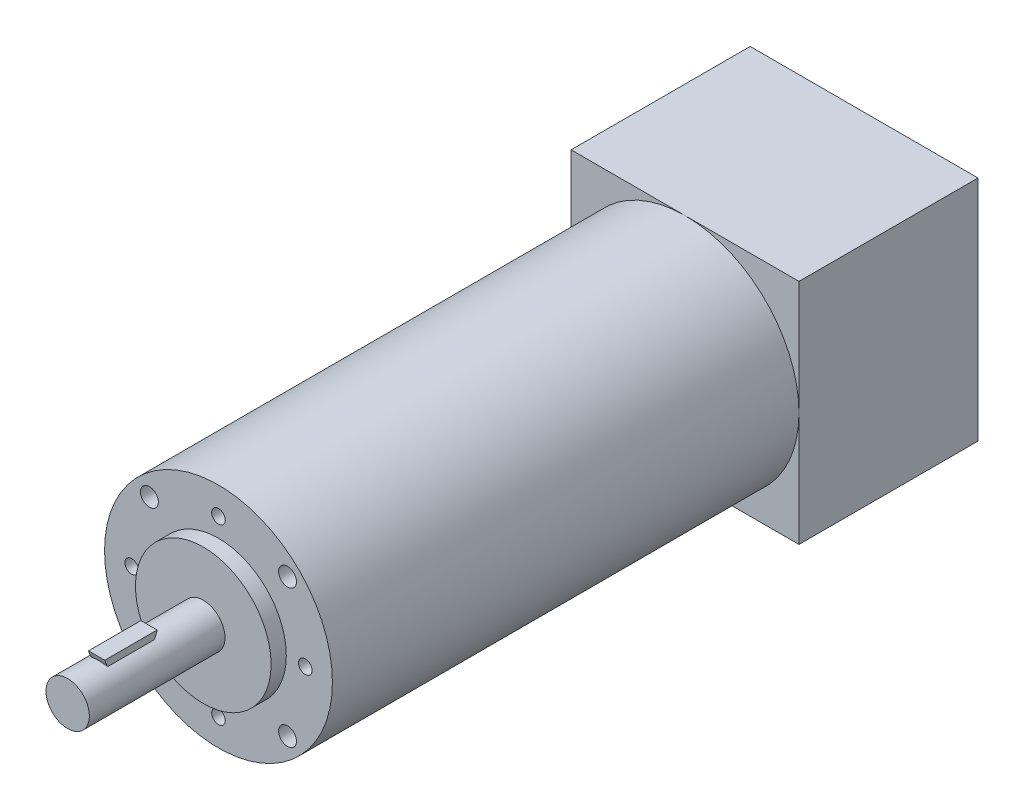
from build123d import *

# Parameters (mm, degrees)
ESQUISSE1_R               = 21
EXTRUSION1_DEPTH          = 43
ESQUISSE2_W               = 42
ESQUISSE2_H               = 42
EXTRUSION2_DEPTH          = 33
ESQUISSE3_R               = 12.5
EXTRUSION3_DEPTH          = 2.8
ESQUISSE4_R               = 4
EXTRUSION4_DEPTH          = 25
EXTRUSION5_DEPTH          = 1.5
TROU_TARAUD_M3X0_51_D     = 2.5
TROU_TARAUD_M3X0_51_DEPTH = 9
TROU_TARAUD_M3X0_51_TIP   = 0.751075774
TROU_TARAUD_M4X0_71_D     = 3.3
TROU_TARAUD_M4X0_71_DEPTH = 9
TROU_TARAUD_M4X0_71_TIP   = 0.991420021


with BuildPart() as part:
    # Esquisse1 → Extrusion1 (new, symmetric)
    with BuildSketch(Plane.XY):
        Circle(ESQUISSE1_R)
    extrude(amount=EXTRUSION1_DEPTH, both=True)

    # Esquisse2 → Extrusion2 (add)
    with BuildSketch(Plane(origin=(0, 0, -43), x_dir=(-1, 0, 0), z_dir=(0, 0, -1))):
        Rectangle(ESQUISSE2_W, ESQUISSE2_H)
    extrude(amount=EXTRUSION2_DEPTH)

    # Esquisse3 → Extrusion3 (add)
    with BuildSketch(Plane.XY.offset(43)):
        Circle(ESQUISSE3_R)
    extrude(amount=EXTRUSION3_DEPTH)

    # Esquisse4 → Extrusion4 (add)
    with BuildSketch(Plane.XY.offset(45.8)):
        Circle(ESQUISSE4_R)
    extrude(amount=EXTRUSION4_DEPTH)

    # Esquisse5 → Extrusion5 (add, symmetric)
    with BuildSketch(Plane(origin=(0, 0, 0), x_dir=(0, 0, -1), z_dir=(1, 0, 0))):
        with BuildLine():
            Line((-65.46, 5), (-55.8, 5))
            ThreePointArc((-55.8, 5), (-60.63, 1.3), (-65.46, 5))
        make_face()
    extrude(amount=EXTRUSION5_DEPTH, both=True)

    # Trou taraud_ M3x0.51
    with Locations(Plane.XY.offset(43)):
        with Locations((16, 0), (0, 16), (-16, 0), (0, -16)):
            Hole(TROU_TARAUD_M3X0_51_D / 2, depth=TROU_TARAUD_M3X0_51_DEPTH)
            with Locations((0, 0, -(TROU_TARAUD_M3X0_51_DEPTH + TROU_TARAUD_M3X0_51_TIP / 2))):  # 118° drill point
                Cone(0, TROU_TARAUD_M3X0_51_D / 2, TROU_TARAUD_M3X0_51_TIP, mode=Mode.SUBTRACT)

    # Trou taraud_ M4x0.71
    with Locations(Plane.XY.offset(43)):
        with Locations((-12.727922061, -12.727922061), (12.727922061, 12.727922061), (-12.727922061, 12.727922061), (12.727922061, -12.727922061)):
            Hole(TROU_TARAUD_M4X0_71_D / 2, depth=TROU_TARAUD_M4X0_71_DEPTH)
            with Locations((0, 0, -(TROU_TARAUD_M4X0_71_DEPTH + TROU_TARAUD_M4X0_71_TIP / 2))):  # 118° drill point
                Cone(0, TROU_TARAUD_M4X0_71_D / 2, TROU_TARAUD_M4X0_71_TIP, mode=Mode.SUBTRACT)


solid = part.part
